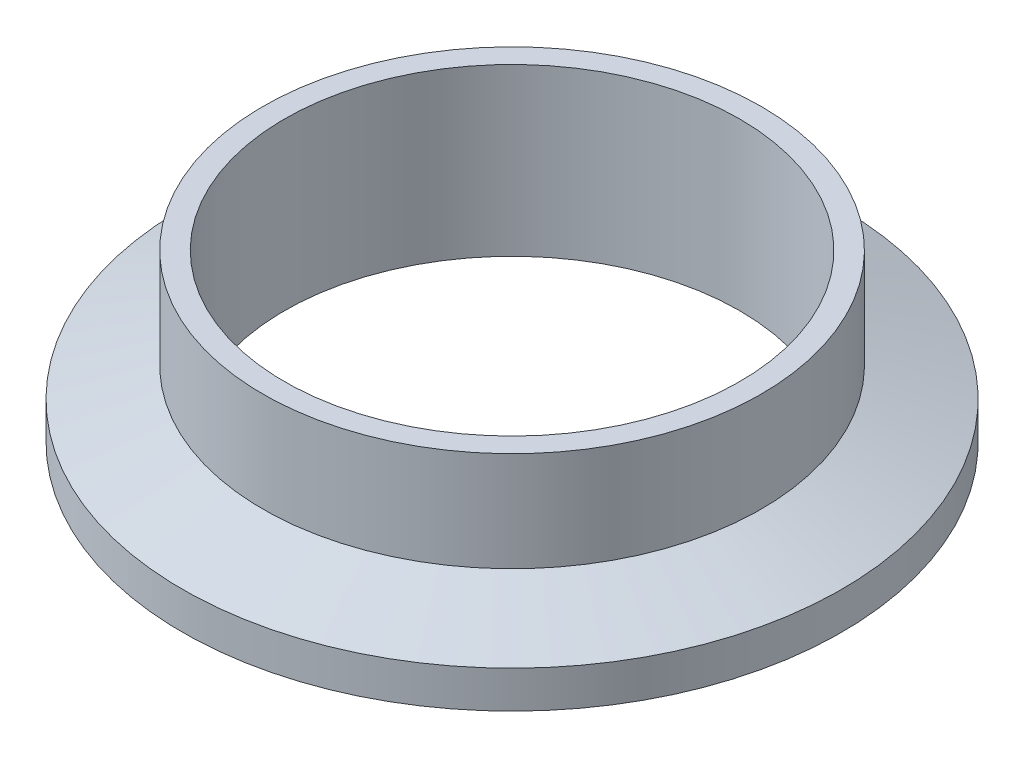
ISO-10303-21;
HEADER;
FILE_DESCRIPTION(('STEP AP214'),'2;1');
FILE_NAME('part.step','',(''),(''),'','','');
FILE_SCHEMA(('AUTOMOTIVE_DESIGN { 1 0 10303 214 1 1 1 1 }'));
ENDSEC;
DATA;
#1=APPLICATION_CONTEXT('core data for automotive mechanical design processes');
#2=APPLICATION_PROTOCOL_DEFINITION('international standard','automotive_design',2000,#1);
#3=PRODUCT_CONTEXT('',#1,'mechanical');
#4=PRODUCT('Part','Part','',(#3));
#5=PRODUCT_RELATED_PRODUCT_CATEGORY('part','',(#4));
#6=PRODUCT_DEFINITION_FORMATION('','',#4);
#7=PRODUCT_DEFINITION_CONTEXT('part definition',#1,'design');
#8=PRODUCT_DEFINITION('design','',#6,#7);
#9=PRODUCT_DEFINITION_SHAPE('','',#8);
#10=(LENGTH_UNIT() NAMED_UNIT(*) SI_UNIT(.MILLI.,.METRE.));
#11=(NAMED_UNIT(*) PLANE_ANGLE_UNIT() SI_UNIT($,.RADIAN.));
#12=(NAMED_UNIT(*) SI_UNIT($,.STERADIAN.) SOLID_ANGLE_UNIT());
#13=UNCERTAINTY_MEASURE_WITH_UNIT(LENGTH_MEASURE(1.E-05),#10,'distance_accuracy_value','');
#14=(GEOMETRIC_REPRESENTATION_CONTEXT(3) GLOBAL_UNCERTAINTY_ASSIGNED_CONTEXT((#13)) GLOBAL_UNIT_ASSIGNED_CONTEXT((#10,
#11,#12)) REPRESENTATION_CONTEXT('',''));
#15=CARTESIAN_POINT('',(0.,0.,0.));
#16=DIRECTION('',(0.,0.,1.));
#17=DIRECTION('',(1.,0.,0.));
#18=AXIS2_PLACEMENT_3D('',#15,#16,#17);
#19=CARTESIAN_POINT('',(3.60822483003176E-13,0.98399896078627,1.87350135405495E-12));
#20=DIRECTION('',(0.,1.00000000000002,0.));
#21=DIRECTION('',(0.,0.,1.00000000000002));
#22=AXIS2_PLACEMENT_3D('',#19,#20,#21);
#23=CONICAL_SURFACE('',#22,20.9336326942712,0.401425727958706);
#24=CARTESIAN_POINT('',(-1.66533453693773E-13,0.46426288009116,2.4008572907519E-12));
#25=DIRECTION('',(0.,-1.00000000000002,0.));
#26=DIRECTION('',(0.,0.,-1.00000000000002));
#27=AXIS2_PLACEMENT_3D('',#24,#25,#26);
#28=CIRCLE('',#27,20.7130178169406);
#29=CARTESIAN_POINT('',(-1.79181291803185E-13,0.464262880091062,-20.7130178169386));
#30=VERTEX_POINT('',#29);
#31=EDGE_CURVE('E12',#30,#30,#28,.T.);
#32=ORIENTED_EDGE('',*,*,#31,.F.);
#33=EDGE_LOOP('',(#32));
#34=FACE_BOUND('',#33,.T.);
#35=CARTESIAN_POINT('',(3.60822483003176E-13,0.98399896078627,1.87350135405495E-12));
#36=DIRECTION('',(0.,-1.00000000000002,0.));
#37=DIRECTION('',(0.,0.,-1.00000000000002));
#38=AXIS2_PLACEMENT_3D('',#35,#36,#37);
#39=CIRCLE('',#38,20.9336326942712);
#40=CARTESIAN_POINT('',(3.48039932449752E-13,0.983998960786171,-20.9336326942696));
#41=VERTEX_POINT('',#40);
#42=EDGE_CURVE('E80',#41,#41,#39,.T.);
#43=ORIENTED_EDGE('',*,*,#42,.T.);
#44=EDGE_LOOP('',(#43));
#45=FACE_BOUND('',#44,.T.);
#46=ADVANCED_FACE('F40',(#34,#45),#23,.T.);
#47=CARTESIAN_POINT('',(0.,0.76200000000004,1.66533453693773E-13));
#48=DIRECTION('',(0.,-1.00000000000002,0.));
#49=DIRECTION('',(0.,0.,-1.00000000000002));
#50=AXIS2_PLACEMENT_3D('',#47,#48,#49);
#51=TOROIDAL_SURFACE('',#50,20.0115931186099,0.761999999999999);
#52=CARTESIAN_POINT('',(0.,0.,0.));
#53=DIRECTION('',(0.,-1.00000000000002,0.));
#54=DIRECTION('',(0.,0.,-1.00000000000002));
#55=AXIS2_PLACEMENT_3D('',#52,#53,#54);
#56=CIRCLE('',#55,20.0115931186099);
#57=CARTESIAN_POINT('',(0.,0.,-20.0115931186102));
#58=VERTEX_POINT('',#57);
#59=EDGE_CURVE('E46',#58,#58,#56,.T.);
#60=ORIENTED_EDGE('',*,*,#59,.F.);
#61=EDGE_LOOP('',(#60));
#62=FACE_BOUND('',#61,.T.);
#63=ORIENTED_EDGE('',*,*,#31,.T.);
#64=EDGE_LOOP('',(#63));
#65=FACE_BOUND('',#64,.T.);
#66=ADVANCED_FACE('F109',(#62,#65),#51,.T.);
#67=CARTESIAN_POINT('',(0.,0.,0.));
#68=DIRECTION('',(0.,1.00000000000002,0.));
#69=DIRECTION('',(0.,0.,1.00000000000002));
#70=AXIS2_PLACEMENT_3D('',#67,#68,#69);
#71=PLANE('',#70);
#72=CARTESIAN_POINT('',(0.,0.,0.));
#73=DIRECTION('',(0.,-1.00000000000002,0.));
#74=DIRECTION('',(0.,0.,-1.00000000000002));
#75=AXIS2_PLACEMENT_3D('',#72,#73,#74);
#76=CIRCLE('',#75,17.399);
#77=CARTESIAN_POINT('',(0.,0.,-17.3990000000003));
#78=VERTEX_POINT('',#77);
#79=EDGE_CURVE('E50',#78,#78,#76,.T.);
#80=ORIENTED_EDGE('',*,*,#79,.F.);
#81=EDGE_LOOP('',(#80));
#82=FACE_BOUND('',#81,.T.);
#83=ORIENTED_EDGE('',*,*,#59,.T.);
#84=EDGE_LOOP('',(#83));
#85=FACE_BOUND('',#84,.T.);
#86=ADVANCED_FACE('F114',(#82,#85),#71,.F.);
#87=CARTESIAN_POINT('',(0.,0.,0.));
#88=DIRECTION('',(0.,-1.00000000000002,0.));
#89=DIRECTION('',(0.,0.,-1.00000000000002));
#90=AXIS2_PLACEMENT_3D('',#87,#88,#89);
#91=CYLINDRICAL_SURFACE('',#90,17.399);
#92=ORIENTED_EDGE('',*,*,#79,.T.);
#93=EDGE_LOOP('',(#92));
#94=FACE_BOUND('',#93,.T.);
#95=CARTESIAN_POINT('',(-6.66133814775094E-13,12.6999999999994,3.28903571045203E-12));
#96=DIRECTION('',(0.,-1.00000000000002,0.));
#97=DIRECTION('',(0.,0.,-1.00000000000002));
#98=AXIS2_PLACEMENT_3D('',#95,#96,#97);
#99=CIRCLE('',#98,17.399);
#100=CARTESIAN_POINT('',(-6.76758038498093E-13,12.6999999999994,-17.398999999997));
#101=VERTEX_POINT('',#100);
#102=EDGE_CURVE('E54',#101,#101,#99,.T.);
#103=ORIENTED_EDGE('',*,*,#102,.F.);
#104=EDGE_LOOP('',(#103));
#105=FACE_BOUND('',#104,.T.);
#106=ADVANCED_FACE('F119',(#94,#105),#91,.F.);
#107=CARTESIAN_POINT('',(-6.66133814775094E-13,12.6999999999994,3.28903571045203E-12));
#108=DIRECTION('',(0.,-1.00000000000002,0.));
#109=DIRECTION('',(0.,0.,-1.00000000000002));
#110=AXIS2_PLACEMENT_3D('',#107,#108,#109);
#111=PLANE('',#110);
#112=CARTESIAN_POINT('',(-6.66133814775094E-13,12.6999999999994,3.28903571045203E-12));
#113=DIRECTION('',(0.,-1.00000000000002,0.));
#114=DIRECTION('',(0.,0.,-1.00000000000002));
#115=AXIS2_PLACEMENT_3D('',#112,#113,#114);
#116=CIRCLE('',#115,19.05);
#117=CARTESIAN_POINT('',(-6.77766176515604E-13,12.6999999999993,-19.049999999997));
#118=VERTEX_POINT('',#117);
#119=EDGE_CURVE('E59',#118,#118,#116,.T.);
#120=ORIENTED_EDGE('',*,*,#119,.F.);
#121=EDGE_LOOP('',(#120));
#122=FACE_BOUND('',#121,.T.);
#123=ORIENTED_EDGE('',*,*,#102,.T.);
#124=EDGE_LOOP('',(#123));
#125=FACE_BOUND('',#124,.T.);
#126=ADVANCED_FACE('F125',(#122,#125),#111,.F.);
#127=CARTESIAN_POINT('',(0.,0.,0.));
#128=DIRECTION('',(0.,-1.00000000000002,0.));
#129=DIRECTION('',(0.,0.,-1.00000000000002));
#130=AXIS2_PLACEMENT_3D('',#127,#128,#129);
#131=CYLINDRICAL_SURFACE('',#130,19.05);
#132=CARTESIAN_POINT('',(-4.71844785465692E-13,5.08205223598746,1.49186218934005E-12));
#133=DIRECTION('',(0.,-1.00000000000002,0.));
#134=DIRECTION('',(0.,0.,-1.00000000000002));
#135=AXIS2_PLACEMENT_3D('',#132,#133,#134);
#136=CIRCLE('',#135,19.05);
#137=CARTESIAN_POINT('',(-4.83477147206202E-13,5.08205223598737,-19.0499999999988));
#138=VERTEX_POINT('',#137);
#139=EDGE_CURVE('E62',#138,#138,#136,.T.);
#140=ORIENTED_EDGE('',*,*,#139,.F.);
#141=EDGE_LOOP('',(#140));
#142=FACE_BOUND('',#141,.T.);
#143=ORIENTED_EDGE('',*,*,#119,.T.);
#144=EDGE_LOOP('',(#143));
#145=FACE_BOUND('',#144,.T.);
#146=ADVANCED_FACE('F129',(#142,#145),#131,.T.);
#147=CARTESIAN_POINT('',(-4.71844785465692E-13,5.08205223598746,1.49186218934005E-12));
#148=DIRECTION('',(0.,-1.00000000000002,0.));
#149=DIRECTION('',(0.,0.,-1.00000000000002));
#150=AXIS2_PLACEMENT_3D('',#147,#148,#149);
#151=CONICAL_SURFACE('',#150,19.05,1.22173047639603);
#152=CARTESIAN_POINT('',(0.,2.84479999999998,2.41473507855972E-12));
#153=DIRECTION('',(0.,-1.00000000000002,0.));
#154=DIRECTION('',(0.,0.,-1.00000000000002));
#155=AXIS2_PLACEMENT_3D('',#152,#153,#154);
#156=CIRCLE('',#155,25.1968);
#157=CARTESIAN_POINT('',(0.,2.84479999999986,-25.196799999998));
#158=VERTEX_POINT('',#157);
#159=EDGE_CURVE('E65',#158,#158,#156,.T.);
#160=ORIENTED_EDGE('',*,*,#159,.F.);
#161=EDGE_LOOP('',(#160));
#162=FACE_BOUND('',#161,.T.);
#163=ORIENTED_EDGE('',*,*,#139,.T.);
#164=EDGE_LOOP('',(#163));
#165=FACE_BOUND('',#164,.T.);
#166=ADVANCED_FACE('F133',(#162,#165),#151,.T.);
#167=CARTESIAN_POINT('',(0.,0.,0.));
#168=DIRECTION('',(0.,-1.00000000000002,0.));
#169=DIRECTION('',(0.,0.,-1.00000000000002));
#170=AXIS2_PLACEMENT_3D('',#167,#168,#169);
#171=CYLINDRICAL_SURFACE('',#170,25.1968);
#172=CARTESIAN_POINT('',(0.,0.,0.));
#173=DIRECTION('',(0.,-1.00000000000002,0.));
#174=DIRECTION('',(0.,0.,-1.00000000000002));
#175=AXIS2_PLACEMENT_3D('',#172,#173,#174);
#176=CIRCLE('',#175,25.1968);
#177=CARTESIAN_POINT('',(0.,-1.18479267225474E-13,-25.1968000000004));
#178=VERTEX_POINT('',#177);
#179=EDGE_CURVE('E68',#178,#178,#176,.T.);
#180=ORIENTED_EDGE('',*,*,#179,.F.);
#181=EDGE_LOOP('',(#180));
#182=FACE_BOUND('',#181,.T.);
#183=ORIENTED_EDGE('',*,*,#159,.T.);
#184=EDGE_LOOP('',(#183));
#185=FACE_BOUND('',#184,.T.);
#186=ADVANCED_FACE('F105',(#182,#185),#171,.T.);
#187=CARTESIAN_POINT('',(0.,0.,0.));
#188=DIRECTION('',(0.,1.00000000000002,0.));
#189=DIRECTION('',(0.,0.,1.00000000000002));
#190=AXIS2_PLACEMENT_3D('',#187,#188,#189);
#191=PLANE('',#190);
#192=CARTESIAN_POINT('',(0.,0.,0.));
#193=DIRECTION('',(0.,-1.00000000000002,0.));
#194=DIRECTION('',(0.,0.,-1.00000000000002));
#195=AXIS2_PLACEMENT_3D('',#192,#193,#194);
#196=CIRCLE('',#195,23.9521599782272);
#197=CARTESIAN_POINT('',(0.,-1.1262677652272E-13,-23.9521599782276));
#198=VERTEX_POINT('',#197);
#199=EDGE_CURVE('E71',#198,#198,#196,.T.);
#200=ORIENTED_EDGE('',*,*,#199,.F.);
#201=EDGE_LOOP('',(#200));
#202=FACE_BOUND('',#201,.T.);
#203=ORIENTED_EDGE('',*,*,#179,.T.);
#204=EDGE_LOOP('',(#203));
#205=FACE_BOUND('',#204,.T.);
#206=ADVANCED_FACE('F99',(#202,#205),#191,.F.);
#207=CARTESIAN_POINT('',(0.,0.76200000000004,1.66533453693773E-13));
#208=DIRECTION('',(0.,-1.00000000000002,0.));
#209=DIRECTION('',(0.,0.,-1.00000000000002));
#210=AXIS2_PLACEMENT_3D('',#207,#208,#209);
#211=TOROIDAL_SURFACE('',#210,23.9521599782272,0.761999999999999);
#212=ORIENTED_EDGE('',*,*,#199,.T.);
#213=EDGE_LOOP('',(#212));
#214=FACE_BOUND('',#213,.T.);
#215=CARTESIAN_POINT('',(-1.66533453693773E-13,0.46426288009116,2.4008572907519E-12));
#216=DIRECTION('',(0.,-1.00000000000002,0.));
#217=DIRECTION('',(0.,0.,-1.00000000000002));
#218=AXIS2_PLACEMENT_3D('',#215,#216,#217);
#219=CIRCLE('',#218,23.2507352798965);
#220=CARTESIAN_POINT('',(-1.80730879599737E-13,0.46426288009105,-23.2507352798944));
#221=VERTEX_POINT('',#220);
#222=EDGE_CURVE('E74',#221,#221,#219,.T.);
#223=ORIENTED_EDGE('',*,*,#222,.F.);
#224=EDGE_LOOP('',(#223));
#225=FACE_BOUND('',#224,.T.);
#226=ADVANCED_FACE('F94',(#214,#225),#211,.T.);
#227=CARTESIAN_POINT('',(-1.66533453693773E-13,0.46426288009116,2.4008572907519E-12));
#228=DIRECTION('',(0.,-1.00000000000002,0.));
#229=DIRECTION('',(0.,0.,-1.00000000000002));
#230=AXIS2_PLACEMENT_3D('',#227,#228,#229);
#231=CONICAL_SURFACE('',#230,23.2507352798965,0.401425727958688);
#232=CARTESIAN_POINT('',(0.,0.872854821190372,1.40165656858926E-12));
#233=DIRECTION('',(0.,-1.00000000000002,0.));
#234=DIRECTION('',(0.,0.,-1.00000000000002));
#235=AXIS2_PLACEMENT_3D('',#232,#233,#234);
#236=CIRCLE('',#235,23.0772982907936);
#237=CARTESIAN_POINT('',(0.,0.872854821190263,-23.0772982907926));
#238=VERTEX_POINT('',#237);
#239=EDGE_CURVE('E77',#238,#238,#236,.T.);
#240=ORIENTED_EDGE('',*,*,#239,.F.);
#241=EDGE_LOOP('',(#240));
#242=FACE_BOUND('',#241,.T.);
#243=ORIENTED_EDGE('',*,*,#222,.T.);
#244=EDGE_LOOP('',(#243));
#245=FACE_BOUND('',#244,.T.);
#246=ADVANCED_FACE('F88',(#242,#245),#231,.F.);
#247=CARTESIAN_POINT('',(0.,0.406399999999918,2.05391259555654E-12));
#248=DIRECTION('',(0.,-1.00000000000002,0.));
#249=DIRECTION('',(0.,0.,-1.00000000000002));
#250=AXIS2_PLACEMENT_3D('',#247,#248,#249);
#251=TOROIDAL_SURFACE('',#250,21.9783995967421,1.1938);
#252=ORIENTED_EDGE('',*,*,#42,.F.);
#253=EDGE_LOOP('',(#252));
#254=FACE_BOUND('',#253,.T.);
#255=ORIENTED_EDGE('',*,*,#239,.T.);
#256=EDGE_LOOP('',(#255));
#257=FACE_BOUND('',#256,.T.);
#258=ADVANCED_FACE('F85',(#254,#257),#251,.F.);
#259=CLOSED_SHELL('',(#46,#66,#86,#106,#126,#146,#166,#186,#206,#226,#246,#258));
#260=MANIFOLD_SOLID_BREP('B2',#259);
#261=ADVANCED_BREP_SHAPE_REPRESENTATION('',(#18,#260),#14);
#262=SHAPE_DEFINITION_REPRESENTATION(#9,#261);
ENDSEC;
END-ISO-10303-21;
